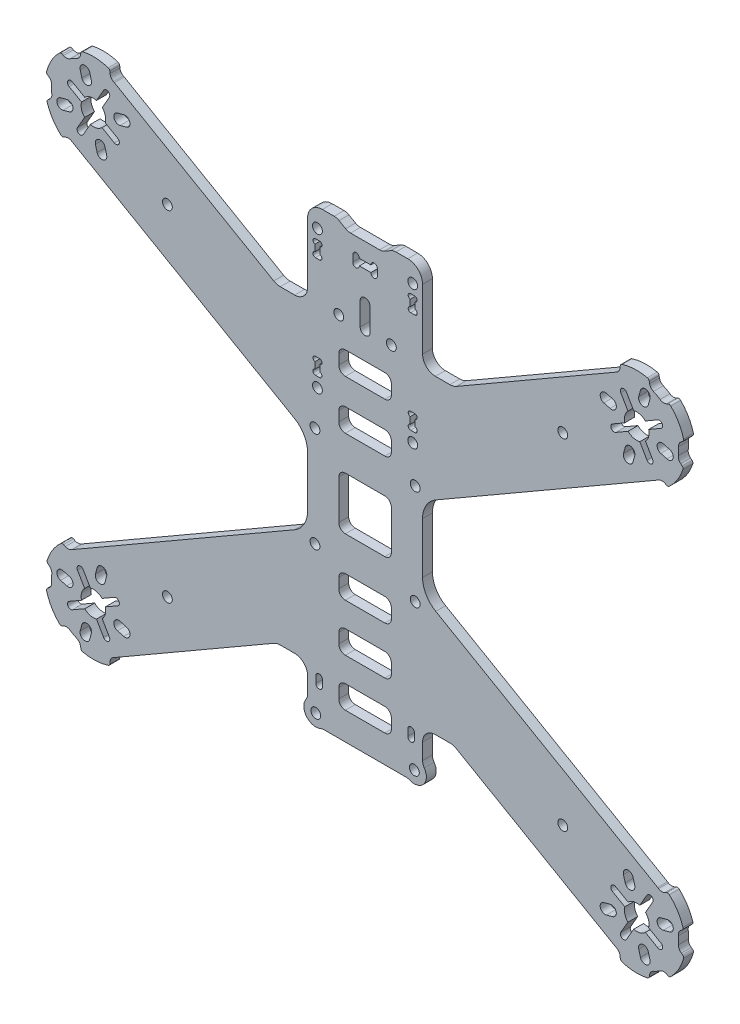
from build123d import *

# Parameters (mm, degrees)
ESQUISSE1_R        = 1.5
BOSS_EXTRU_1_DEPTH = 3


with BuildPart() as part:
    # Esquisse1 → Boss.-Extru.1 (new body)
    with BuildSketch(Plane(origin=(0, 0, 0), x_dir=(-1, 0, 0), z_dir=(0, 0, -1))):
        with BuildLine():
            Line((13, 74.000001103), (9.404163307, 74.000001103))
            ThreePointArc((9.404163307, 74.000001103), (8.634495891, 73.899589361), (7.916350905, 73.605075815))
            Line((7.916350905, 73.605075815), (5.914423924, 72.461733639))
            ThreePointArc((5.914423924, 72.461733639), (5.196278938, 72.167220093), (4.426611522, 72.066808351))
            Line((4.426611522, 72.066808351), (-4.426611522, 72.066808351))
            ThreePointArc((-4.426611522, 72.066808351), (-5.196278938, 72.167220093), (-5.914423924, 72.461733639))
            Line((-5.914423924, 72.461733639), (-7.916350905, 73.605075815))
            ThreePointArc((-7.916350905, 73.605075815), (-8.634495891, 73.899589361), (-9.404163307, 74.000001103))
            Line((-9.404163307, 74.000001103), (-13, 74.000001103))
            ThreePointArc((-13, 74.000001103), (-16.181980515, 72.681981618), (-17.5, 69.500001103))
            Line((-17.5, 69.500001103), (-17.5, 51.136797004))
            ThreePointArc((-17.5, 51.136797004), (-18.645234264, 48.371956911), (-21.410074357, 47.226722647))
            Line((-21.410074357, 47.226722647), (-25.80389257, 47.226722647))
            ThreePointArc((-25.80389257, 47.226722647), (-26.839168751, 47.363019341), (-27.80389257, 47.762621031))
            Line((-27.80389257, 47.762621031), (-76.304836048, 75.764653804))
            ThreePointArc((-76.304836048, 75.764653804), (-76.443738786, 75.843692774), (-76.583621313, 75.920984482))
            ThreePointArc((-76.583621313, 75.920984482), (-77.299049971, 76.579638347), (-77.619262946, 77.497857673))
            Line((-77.619262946, 77.497857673), (-77.674115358, 78.105876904))
            ThreePointArc((-77.674115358, 78.105876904), (-77.835837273, 78.507519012), (-78.192609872, 78.752842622))
            ThreePointArc((-78.192609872, 78.752842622), (-82.037317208, 79.438930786), (-85.927190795, 79.090541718))
            ThreePointArc((-85.927190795, 79.090541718), (-86.303987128, 78.87724642), (-86.500099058, 78.491227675))
            Line((-86.500099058, 78.491227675), (-86.607735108, 77.890302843))
            ThreePointArc((-86.607735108, 77.890302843), (-87.006757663, 77.003486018), (-87.776869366, 76.409692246))
            ThreePointArc((-87.776869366, 76.409692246), (-88.810662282, 75.902072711), (-89.7944316, 75.303237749))
            ThreePointArc((-89.7944316, 75.303237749), (-90.765401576, 74.968176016), (-91.774628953, 75.159249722))
            Line((-91.774628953, 75.159249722), (-92.174541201, 75.350858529))
            ThreePointArc((-92.174541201, 75.350858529), (-92.622489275, 75.414184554), (-93.025363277, 75.208368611))
            ThreePointArc((-93.025363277, 75.208368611), (-95.436494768, 72.087890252), (-96.933342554, 68.439549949))
            ThreePointArc((-96.933342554, 68.439549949), (-96.910147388, 67.987742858), (-96.631331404, 67.631471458))
            Line((-96.631331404, 67.631471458), (-96.265437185, 67.380941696))
            ThreePointArc((-96.265437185, 67.380941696), (-95.595348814, 66.602462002), (-95.400035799, 65.59404647))
            ThreePointArc((-95.400035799, 65.59404647), (-95.426757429, 64.442659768), (-95.349472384, 63.293559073))
            ThreePointArc((-95.349472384, 63.293559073), (-95.478657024, 62.329725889), (-96.047151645, 61.540753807))
            Line((-96.047151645, 61.540753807), (-96.51374979, 61.147075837))
            ThreePointArc((-96.51374979, 61.147075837), (-96.749995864, 60.784228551), (-96.746316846, 60.351265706))
            ThreePointArc((-96.746316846, 60.351265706), (-95.103093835, 56.808341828), (-92.586570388, 53.821771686))
            ThreePointArc((-92.586570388, 53.821771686), (-92.19572761, 53.635459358), (-91.767034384, 53.696225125))
            Line((-91.767034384, 53.696225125), (-91.213048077, 53.952731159))
            ThreePointArc((-91.213048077, 53.952731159), (-90.257740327, 54.134528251), (-89.329615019, 53.844275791))
            ThreePointArc((-89.329615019, 53.844275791), (-89.192737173, 53.761779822), (-89.054836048, 53.681006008))
            Line((-89.054836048, 53.681006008), (-21.5, 14.67820323))
            ThreePointArc((-21.5, 14.67820323), (-18.57179677, 11.75), (-17.5, 7.75))
            Line((-17.5, 7.75), (-17.5, -7.75))
            ThreePointArc((-17.5, -7.75), (-18.57179677, -11.75), (-21.5, -14.67820323))
            Line((-21.5, -14.67820323), (-89.054836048, -53.681006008))
            ThreePointArc((-89.054836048, -53.681006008), (-89.192737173, -53.761779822), (-89.329615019, -53.844275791))
            ThreePointArc((-89.329615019, -53.844275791), (-90.257740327, -54.134528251), (-91.213048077, -53.952731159))
            Line((-91.213048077, -53.952731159), (-91.767034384, -53.696225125))
            ThreePointArc((-91.767034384, -53.696225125), (-92.19572761, -53.635459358), (-92.586570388, -53.821771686))
            ThreePointArc((-92.586570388, -53.821771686), (-95.103093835, -56.808341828), (-96.746316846, -60.351265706))
            ThreePointArc((-96.746316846, -60.351265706), (-96.749995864, -60.784228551), (-96.51374979, -61.147075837))
            Line((-96.51374979, -61.147075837), (-96.047151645, -61.540753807))
            ThreePointArc((-96.047151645, -61.540753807), (-95.478657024, -62.329725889), (-95.349472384, -63.293559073))
            ThreePointArc((-95.349472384, -63.293559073), (-95.426757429, -64.442659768), (-95.400035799, -65.59404647))
            ThreePointArc((-95.400035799, -65.59404647), (-95.595348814, -66.602462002), (-96.265437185, -67.380941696))
            Line((-96.265437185, -67.380941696), (-96.631331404, -67.631471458))
            ThreePointArc((-96.631331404, -67.631471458), (-96.910147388, -67.987742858), (-96.933342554, -68.439549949))
            ThreePointArc((-96.933342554, -68.439549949), (-95.436494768, -72.087890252), (-93.025363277, -75.208368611))
            ThreePointArc((-93.025363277, -75.208368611), (-92.622489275, -75.414184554), (-92.174541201, -75.350858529))
            Line((-92.174541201, -75.350858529), (-91.774628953, -75.159249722))
            ThreePointArc((-91.774628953, -75.159249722), (-90.765401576, -74.968176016), (-89.7944316, -75.303237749))
            ThreePointArc((-89.7944316, -75.303237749), (-88.810662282, -75.902072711), (-87.776869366, -76.409692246))
            ThreePointArc((-87.776869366, -76.409692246), (-87.006757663, -77.003486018), (-86.607735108, -77.890302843))
            Line((-86.607735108, -77.890302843), (-86.500099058, -78.491227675))
            ThreePointArc((-86.500099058, -78.491227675), (-86.303987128, -78.87724642), (-85.927190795, -79.090541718))
            ThreePointArc((-85.927190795, -79.090541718), (-82.037317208, -79.438930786), (-78.192609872, -78.752842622))
            ThreePointArc((-78.192609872, -78.752842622), (-77.835837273, -78.507519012), (-77.674115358, -78.105876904))
            Line((-77.674115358, -78.105876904), (-77.619262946, -77.497857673))
            ThreePointArc((-77.619262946, -77.497857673), (-77.299049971, -76.579638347), (-76.583621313, -75.920984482))
            ThreePointArc((-76.583621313, -75.920984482), (-76.443738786, -75.843692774), (-76.304836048, -75.764653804))
            Line((-76.304836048, -75.764653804), (-27.80389257, -47.762621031))
            ThreePointArc((-27.80389257, -47.762621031), (-26.839168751, -47.363019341), (-25.80389257, -47.226722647))
            Line((-25.80389257, -47.226722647), (-21.410074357, -47.226722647))
            ThreePointArc((-21.410074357, -47.226722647), (-18.645234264, -48.371956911), (-17.5, -51.136797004))
            Line((-17.5, -51.136797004), (-17.5, -56.007516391))
            ThreePointArc((-17.5, -56.007516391), (-17.632878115, -56.890472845), (-18.019741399, -57.695212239))
            ThreePointArc((-18.019741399, -57.695212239), (-17.830684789, -62.058292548), (-13.594895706, -63.121449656))
            ThreePointArc((-13.594895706, -63.121449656), (-13.029288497, -62.948865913), (-12.440816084, -62.890583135))
            Line((-12.440816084, -62.890583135), (12.440816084, -62.890583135))
            ThreePointArc((12.440816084, -62.890583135), (13.029288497, -62.948865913), (13.594895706, -63.121449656))
            ThreePointArc((13.594895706, -63.121449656), (17.830684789, -62.058292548), (18.019741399, -57.695212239))
            ThreePointArc((18.019741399, -57.695212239), (17.632878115, -56.890472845), (17.5, -56.007516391))
            Line((17.5, -56.007516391), (17.5, -51.136797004))
            ThreePointArc((17.5, -51.136797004), (18.645234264, -48.371956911), (21.410074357, -47.226722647))
            Line((21.410074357, -47.226722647), (25.80389257, -47.226722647))
            ThreePointArc((25.80389257, -47.226722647), (26.839168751, -47.363019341), (27.80389257, -47.762621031))
            Line((27.80389257, -47.762621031), (76.304836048, -75.764653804))
            ThreePointArc((76.304836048, -75.764653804), (76.443738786, -75.843692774), (76.583621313, -75.920984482))
            ThreePointArc((76.583621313, -75.920984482), (77.299049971, -76.579638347), (77.619262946, -77.497857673))
            Line((77.619262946, -77.497857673), (77.674115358, -78.105876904))
            ThreePointArc((77.674115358, -78.105876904), (77.835837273, -78.507519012), (78.192609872, -78.752842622))
            ThreePointArc((78.192609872, -78.752842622), (82.037317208, -79.438930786), (85.927190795, -79.090541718))
            ThreePointArc((85.927190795, -79.090541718), (86.303987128, -78.87724642), (86.500099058, -78.491227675))
            Line((86.500099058, -78.491227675), (86.607735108, -77.890302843))
            ThreePointArc((86.607735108, -77.890302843), (87.006757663, -77.003486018), (87.776869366, -76.409692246))
            ThreePointArc((87.776869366, -76.409692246), (88.810662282, -75.902072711), (89.7944316, -75.303237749))
            ThreePointArc((89.7944316, -75.303237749), (90.765401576, -74.968176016), (91.774628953, -75.159249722))
            Line((91.774628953, -75.159249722), (92.174541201, -75.350858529))
            ThreePointArc((92.174541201, -75.350858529), (92.622489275, -75.414184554), (93.025363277, -75.208368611))
            ThreePointArc((93.025363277, -75.208368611), (95.436494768, -72.087890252), (96.933342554, -68.439549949))
            ThreePointArc((96.933342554, -68.439549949), (96.910147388, -67.987742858), (96.631331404, -67.631471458))
            Line((96.631331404, -67.631471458), (96.265437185, -67.380941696))
            ThreePointArc((96.265437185, -67.380941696), (95.595348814, -66.602462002), (95.400035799, -65.59404647))
            ThreePointArc((95.400035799, -65.59404647), (95.426757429, -64.442659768), (95.349472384, -63.293559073))
            ThreePointArc((95.349472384, -63.293559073), (95.478657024, -62.329725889), (96.047151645, -61.540753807))
            Line((96.047151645, -61.540753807), (96.51374979, -61.147075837))
            ThreePointArc((96.51374979, -61.147075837), (96.749995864, -60.784228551), (96.746316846, -60.351265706))
            ThreePointArc((96.746316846, -60.351265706), (95.103093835, -56.808341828), (92.586570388, -53.821771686))
            ThreePointArc((92.586570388, -53.821771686), (92.19572761, -53.635459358), (91.767034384, -53.696225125))
            Line((91.767034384, -53.696225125), (91.213048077, -53.952731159))
            ThreePointArc((91.213048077, -53.952731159), (90.257740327, -54.134528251), (89.329615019, -53.844275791))
            ThreePointArc((89.329615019, -53.844275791), (89.192737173, -53.761779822), (89.054836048, -53.681006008))
            Line((89.054836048, -53.681006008), (21.5, -14.67820323))
            ThreePointArc((21.5, -14.67820323), (18.57179677, -11.75), (17.5, -7.75))
            Line((17.5, -7.75), (17.5, 7.75))
            ThreePointArc((17.5, 7.75), (18.57179677, 11.75), (21.5, 14.67820323))
            Line((21.5, 14.67820323), (89.054836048, 53.681006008))
            ThreePointArc((89.054836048, 53.681006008), (89.192737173, 53.761779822), (89.329615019, 53.844275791))
            ThreePointArc((89.329615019, 53.844275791), (90.257740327, 54.134528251), (91.213048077, 53.952731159))
            Line((91.213048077, 53.952731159), (91.767034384, 53.696225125))
            ThreePointArc((91.767034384, 53.696225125), (92.19572761, 53.635459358), (92.586570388, 53.821771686))
            ThreePointArc((92.586570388, 53.821771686), (95.103093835, 56.808341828), (96.746316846, 60.351265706))
            ThreePointArc((96.746316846, 60.351265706), (96.749995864, 60.784228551), (96.51374979, 61.147075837))
            Line((96.51374979, 61.147075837), (96.047151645, 61.540753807))
            ThreePointArc((96.047151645, 61.540753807), (95.478657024, 62.329725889), (95.349472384, 63.293559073))
            ThreePointArc((95.349472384, 63.293559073), (95.426757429, 64.442659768), (95.400035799, 65.59404647))
            ThreePointArc((95.400035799, 65.59404647), (95.595348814, 66.602462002), (96.265437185, 67.380941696))
            Line((96.265437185, 67.380941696), (96.631331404, 67.631471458))
            ThreePointArc((96.631331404, 67.631471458), (96.910147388, 67.987742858), (96.933342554, 68.439549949))
            ThreePointArc((96.933342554, 68.439549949), (95.436494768, 72.087890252), (93.025363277, 75.208368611))
            ThreePointArc((93.025363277, 75.208368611), (92.622489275, 75.414184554), (92.174541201, 75.350858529))
            Line((92.174541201, 75.350858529), (91.774628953, 75.159249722))
            ThreePointArc((91.774628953, 75.159249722), (90.765401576, 74.968176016), (89.7944316, 75.303237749))
            ThreePointArc((89.7944316, 75.303237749), (88.810662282, 75.902072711), (87.776869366, 76.409692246))
            ThreePointArc((87.776869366, 76.409692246), (87.006757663, 77.003486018), (86.607735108, 77.890302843))
            Line((86.607735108, 77.890302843), (86.500099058, 78.491227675))
            ThreePointArc((86.500099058, 78.491227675), (86.303987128, 78.87724642), (85.927190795, 79.090541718))
            ThreePointArc((85.927190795, 79.090541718), (82.037317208, 79.438930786), (78.192609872, 78.752842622))
            ThreePointArc((78.192609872, 78.752842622), (77.835837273, 78.507519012), (77.674115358, 78.105876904))
            Line((77.674115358, 78.105876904), (77.619262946, 77.497857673))
            ThreePointArc((77.619262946, 77.497857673), (77.299049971, 76.579638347), (76.583621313, 75.920984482))
            ThreePointArc((76.583621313, 75.920984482), (76.443738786, 75.843692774), (76.304836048, 75.764653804))
            Line((76.304836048, 75.764653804), (27.80389257, 47.762621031))
            ThreePointArc((27.80389257, 47.762621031), (26.839168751, 47.363019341), (25.80389257, 47.226722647))
            Line((25.80389257, 47.226722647), (21.410074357, 47.226722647))
            ThreePointArc((21.410074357, 47.226722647), (18.645234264, 48.371956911), (17.5, 51.136797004))
            Line((17.5, 51.136797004), (17.5, 69.500001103))
            ThreePointArc((17.5, 69.500001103), (16.181980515, 72.681981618), (13, 74.000001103))
        make_face()
        with Locations(Location((15, -59.75, 0), (0, 0, 180))):
            Circle(ESQUISSE1_R, mode=Mode.SUBTRACT)
        with Locations(Location((-14.5, 68.25, 0), (0, 0, 180))):
            Circle(ESQUISSE1_R, mode=Mode.SUBTRACT)
        with Locations(Location((14.5, 26.25, 0), (0, 0, 180))):
            Circle(ESQUISSE1_R, mode=Mode.SUBTRACT)
        with Locations(Location((-15.25, 15.25, 0), (0, 0, 180))):
            Circle(ESQUISSE1_R, mode=Mode.SUBTRACT)
        with Locations(Location((15.25, -15.25, 0), (0, 0, 180))):
            Circle(ESQUISSE1_R, mode=Mode.SUBTRACT)
        with Locations(Location((15.25, 15.25, 0), (0, 0, 180))):
            Circle(ESQUISSE1_R, mode=Mode.SUBTRACT)
        with Locations(Location((-15.25, -15.25, 0), (0, 0, 180))):
            Circle(ESQUISSE1_R, mode=Mode.SUBTRACT)
        with Locations(Location((-14.5, 26.25, 0), (0, 0, 180))):
            Circle(ESQUISSE1_R, mode=Mode.SUBTRACT)
        with Locations(Location((14.5, 68.25, 0), (0, 0, 180))):
            Circle(ESQUISSE1_R, mode=Mode.SUBTRACT)
        with Locations(Location((-15, -59.75, 0), (0, 0, 180))):
            Circle(ESQUISSE1_R, mode=Mode.SUBTRACT)
        with Locations(Location((8, 48.75, 0), (0, 0, 180))):
            Circle(ESQUISSE1_R, mode=Mode.SUBTRACT)
        with Locations(Location((-8, 48.75, 0), (0, 0, 180))):
            Circle(ESQUISSE1_R, mode=Mode.SUBTRACT)
        with Locations(Location((-60.16317555, 51.722829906, 0), (0, 0, 180))):
            Circle(ESQUISSE1_R, mode=Mode.SUBTRACT)
        with Locations(Location((60.16317555, -51.722829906, 0), (0, 0, 180))):
            Circle(ESQUISSE1_R, mode=Mode.SUBTRACT)
        with Locations(Location((-60.16317555, -51.722829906, 0), (0, 0, 180))):
            Circle(ESQUISSE1_R, mode=Mode.SUBTRACT)
        with Locations(Location((60.16317555, 51.722829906, 0), (0, 0, 180))):
            Circle(ESQUISSE1_R, mode=Mode.SUBTRACT)
        with BuildLine():
            Line((80.049840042, 62.049700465), (76.287170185, 59.877322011))
            ThreePointArc((76.287170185, 59.877322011), (74.921144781, 60.243347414), (75.287170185, 61.609372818))
            Line((75.287170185, 61.609372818), (79.049840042, 63.781751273))
            ThreePointArc((79.049840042, 63.781751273), (79.0576142, 65.693401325), (80.006706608, 67.352825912))
            Line((80.006706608, 67.352825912), (77.834328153, 71.115495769))
            ThreePointArc((77.834328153, 71.115495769), (78.200353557, 72.481521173), (79.56637896, 72.115495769))
            Line((79.56637896, 72.115495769), (81.738757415, 68.352825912))
            ThreePointArc((81.738757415, 68.352825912), (83.650407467, 68.345051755), (85.309832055, 67.395959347))
            Line((85.309832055, 67.395959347), (89.072501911, 69.568337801))
            ThreePointArc((89.072501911, 69.568337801), (90.438527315, 69.202312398), (90.072501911, 67.836286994))
            Line((90.072501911, 67.836286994), (86.309832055, 65.663908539))
            ThreePointArc((86.309832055, 65.663908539), (86.302057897, 63.752258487), (85.352965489, 62.0928339))
            Line((85.352965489, 62.0928339), (87.525343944, 58.330164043))
            ThreePointArc((87.525343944, 58.330164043), (87.15931854, 56.964138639), (85.793293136, 57.330164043))
            Line((85.793293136, 57.330164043), (83.620914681, 61.0928339))
            ThreePointArc((83.620914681, 61.0928339), (81.709264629, 61.100608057), (80.049840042, 62.049700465))
        make_face(mode=Mode.SUBTRACT)
        with BuildLine():
            Line((83.297389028, 72.82312396), (83.80938347, 74.73391323))
            ThreePointArc((83.80938347, 74.73391323), (85.646500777, 75.794573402), (86.707160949, 73.957456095))
            Line((86.707160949, 73.957456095), (86.195166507, 72.046666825))
            ThreePointArc((86.195166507, 72.046666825), (84.3580492, 70.986006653), (83.297389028, 72.82312396))
        make_face(mode=Mode.SUBTRACT)
        with BuildLine():
            Line((90.780130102, 64.105276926), (92.690919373, 63.593282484))
            ThreePointArc((92.690919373, 63.593282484), (93.751579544, 61.756165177), (91.914462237, 60.695505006))
            Line((91.914462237, 60.695505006), (90.003672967, 61.207499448))
            ThreePointArc((90.003672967, 61.207499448), (88.943012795, 63.044616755), (90.780130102, 64.105276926))
        make_face(mode=Mode.SUBTRACT)
        with BuildLine():
            Line((74.579541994, 65.340382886), (72.668752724, 65.852377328))
            ThreePointArc((72.668752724, 65.852377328), (71.608092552, 67.689494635), (73.445209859, 68.750154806))
            Line((73.445209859, 68.750154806), (75.355999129, 68.238160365))
            ThreePointArc((75.355999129, 68.238160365), (76.416659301, 66.401043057), (74.579541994, 65.340382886))
        make_face(mode=Mode.SUBTRACT)
        with BuildLine():
            Line((82.062283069, 56.622535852), (81.550288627, 54.711746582))
            ThreePointArc((81.550288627, 54.711746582), (79.71317132, 53.65108641), (78.652511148, 55.488203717))
            Line((78.652511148, 55.488203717), (79.16450559, 57.398992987))
            ThreePointArc((79.16450559, 57.398992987), (81.001622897, 58.459653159), (82.062283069, 56.622535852))
        make_face(mode=Mode.SUBTRACT)
        with BuildLine():
            Line((-77.834328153, 71.115495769), (-80.006706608, 67.352825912))
            ThreePointArc((-80.006706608, 67.352825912), (-79.0576142, 65.693401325), (-79.049840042, 63.781751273))
            Line((-79.049840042, 63.781751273), (-75.287170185, 61.609372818))
            ThreePointArc((-75.287170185, 61.609372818), (-74.921144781, 60.243347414), (-76.287170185, 59.877322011))
            Line((-76.287170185, 59.877322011), (-80.049840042, 62.049700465))
            ThreePointArc((-80.049840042, 62.049700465), (-81.709264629, 61.100608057), (-83.620914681, 61.0928339))
            Line((-83.620914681, 61.0928339), (-85.793293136, 57.330164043))
            ThreePointArc((-85.793293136, 57.330164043), (-87.15931854, 56.964138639), (-87.525343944, 58.330164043))
            Line((-87.525343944, 58.330164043), (-85.352965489, 62.0928339))
            ThreePointArc((-85.352965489, 62.0928339), (-86.302057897, 63.752258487), (-86.309832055, 65.663908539))
            Line((-86.309832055, 65.663908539), (-90.072501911, 67.836286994))
            ThreePointArc((-90.072501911, 67.836286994), (-90.438527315, 69.202312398), (-89.072501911, 69.568337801))
            Line((-89.072501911, 69.568337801), (-85.309832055, 67.395959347))
            ThreePointArc((-85.309832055, 67.395959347), (-83.650407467, 68.345051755), (-81.738757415, 68.352825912))
            Line((-81.738757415, 68.352825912), (-79.56637896, 72.115495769))
            ThreePointArc((-79.56637896, 72.115495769), (-78.200353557, 72.481521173), (-77.834328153, 71.115495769))
        make_face(mode=Mode.SUBTRACT)
        with BuildLine():
            Line((-83.80938347, 74.73391323), (-83.297389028, 72.82312396))
            ThreePointArc((-83.297389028, 72.82312396), (-84.3580492, 70.986006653), (-86.195166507, 72.046666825))
            Line((-86.195166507, 72.046666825), (-86.707160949, 73.957456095))
            ThreePointArc((-86.707160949, 73.957456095), (-85.646500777, 75.794573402), (-83.80938347, 74.73391323))
        make_face(mode=Mode.SUBTRACT)
        with BuildLine():
            Line((-92.690919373, 63.593282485), (-90.780130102, 64.105276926))
            ThreePointArc((-90.780130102, 64.105276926), (-88.943012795, 63.044616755), (-90.003672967, 61.207499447))
            Line((-90.003672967, 61.207499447), (-91.914462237, 60.695505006))
            ThreePointArc((-91.914462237, 60.695505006), (-93.751579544, 61.756165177), (-92.690919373, 63.593282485))
        make_face(mode=Mode.SUBTRACT)
        with BuildLine():
            Line((-72.668752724, 65.852377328), (-74.579541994, 65.340382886))
            ThreePointArc((-74.579541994, 65.340382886), (-76.416659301, 66.401043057), (-75.355999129, 68.238160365))
            Line((-75.355999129, 68.238160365), (-73.445209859, 68.750154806))
            ThreePointArc((-73.445209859, 68.750154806), (-71.608092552, 67.689494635), (-72.668752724, 65.852377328))
        make_face(mode=Mode.SUBTRACT)
        with BuildLine():
            Line((-81.550288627, 54.711746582), (-82.062283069, 56.622535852))
            ThreePointArc((-82.062283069, 56.622535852), (-81.001622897, 58.459653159), (-79.16450559, 57.398992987))
            Line((-79.16450559, 57.398992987), (-78.652511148, 55.488203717))
            ThreePointArc((-78.652511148, 55.488203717), (-79.71317132, 53.65108641), (-81.550288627, 54.711746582))
        make_face(mode=Mode.SUBTRACT)
        with BuildLine():
            Line((77.834328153, -71.115495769), (80.006706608, -67.352825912))
            ThreePointArc((80.006706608, -67.352825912), (79.0576142, -65.693401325), (79.049840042, -63.781751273))
            Line((79.049840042, -63.781751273), (75.287170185, -61.609372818))
            ThreePointArc((75.287170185, -61.609372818), (74.921144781, -60.243347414), (76.287170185, -59.877322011))
            Line((76.287170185, -59.877322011), (80.049840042, -62.049700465))
            ThreePointArc((80.049840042, -62.049700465), (81.709264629, -61.100608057), (83.620914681, -61.0928339))
            Line((83.620914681, -61.0928339), (85.793293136, -57.330164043))
            ThreePointArc((85.793293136, -57.330164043), (87.15931854, -56.964138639), (87.525343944, -58.330164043))
            Line((87.525343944, -58.330164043), (85.352965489, -62.0928339))
            ThreePointArc((85.352965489, -62.0928339), (86.302057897, -63.752258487), (86.309832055, -65.663908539))
            Line((86.309832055, -65.663908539), (90.072501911, -67.836286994))
            ThreePointArc((90.072501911, -67.836286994), (90.438527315, -69.202312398), (89.072501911, -69.568337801))
            Line((89.072501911, -69.568337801), (85.309832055, -67.395959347))
            ThreePointArc((85.309832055, -67.395959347), (83.650407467, -68.345051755), (81.738757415, -68.352825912))
            Line((81.738757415, -68.352825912), (79.56637896, -72.115495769))
            ThreePointArc((79.56637896, -72.115495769), (78.200353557, -72.481521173), (77.834328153, -71.115495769))
        make_face(mode=Mode.SUBTRACT)
        with BuildLine():
            Line((83.80938347, -74.73391323), (83.297389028, -72.82312396))
            ThreePointArc((83.297389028, -72.82312396), (84.3580492, -70.986006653), (86.195166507, -72.046666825))
            Line((86.195166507, -72.046666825), (86.707160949, -73.957456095))
            ThreePointArc((86.707160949, -73.957456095), (85.646500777, -75.794573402), (83.80938347, -74.73391323))
        make_face(mode=Mode.SUBTRACT)
        with BuildLine():
            Line((92.690919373, -63.593282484), (90.780130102, -64.105276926))
            ThreePointArc((90.780130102, -64.105276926), (88.943012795, -63.044616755), (90.003672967, -61.207499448))
            Line((90.003672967, -61.207499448), (91.914462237, -60.695505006))
            ThreePointArc((91.914462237, -60.695505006), (93.751579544, -61.756165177), (92.690919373, -63.593282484))
        make_face(mode=Mode.SUBTRACT)
        with BuildLine():
            Line((72.668752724, -65.852377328), (74.579541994, -65.340382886))
            ThreePointArc((74.579541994, -65.340382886), (76.416659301, -66.401043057), (75.355999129, -68.238160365))
            Line((75.355999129, -68.238160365), (73.445209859, -68.750154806))
            ThreePointArc((73.445209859, -68.750154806), (71.608092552, -67.689494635), (72.668752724, -65.852377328))
        make_face(mode=Mode.SUBTRACT)
        with BuildLine():
            Line((81.550288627, -54.711746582), (82.062283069, -56.622535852))
            ThreePointArc((82.062283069, -56.622535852), (81.001622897, -58.459653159), (79.16450559, -57.398992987))
            Line((79.16450559, -57.398992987), (78.652511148, -55.488203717))
            ThreePointArc((78.652511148, -55.488203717), (79.71317132, -53.65108641), (81.550288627, -54.711746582))
        make_face(mode=Mode.SUBTRACT)
        with BuildLine():
            Line((-80.049840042, -62.049700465), (-76.287170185, -59.877322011))
            ThreePointArc((-76.287170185, -59.877322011), (-74.921144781, -60.243347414), (-75.287170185, -61.609372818))
            Line((-75.287170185, -61.609372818), (-79.049840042, -63.781751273))
            ThreePointArc((-79.049840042, -63.781751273), (-79.0576142, -65.693401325), (-80.006706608, -67.352825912))
            Line((-80.006706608, -67.352825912), (-77.834328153, -71.115495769))
            ThreePointArc((-77.834328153, -71.115495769), (-78.200353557, -72.481521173), (-79.56637896, -72.115495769))
            Line((-79.56637896, -72.115495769), (-81.738757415, -68.352825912))
            ThreePointArc((-81.738757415, -68.352825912), (-83.650407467, -68.345051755), (-85.309832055, -67.395959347))
            Line((-85.309832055, -67.395959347), (-89.072501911, -69.568337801))
            ThreePointArc((-89.072501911, -69.568337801), (-90.438527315, -69.202312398), (-90.072501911, -67.836286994))
            Line((-90.072501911, -67.836286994), (-86.309832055, -65.663908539))
            ThreePointArc((-86.309832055, -65.663908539), (-86.302057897, -63.752258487), (-85.352965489, -62.0928339))
            Line((-85.352965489, -62.0928339), (-87.525343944, -58.330164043))
            ThreePointArc((-87.525343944, -58.330164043), (-87.15931854, -56.964138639), (-85.793293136, -57.330164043))
            Line((-85.793293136, -57.330164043), (-83.620914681, -61.0928339))
            ThreePointArc((-83.620914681, -61.0928339), (-81.709264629, -61.100608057), (-80.049840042, -62.049700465))
        make_face(mode=Mode.SUBTRACT)
        with BuildLine():
            Line((-83.297389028, -72.82312396), (-83.80938347, -74.73391323))
            ThreePointArc((-83.80938347, -74.73391323), (-85.646500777, -75.794573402), (-86.707160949, -73.957456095))
            Line((-86.707160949, -73.957456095), (-86.195166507, -72.046666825))
            ThreePointArc((-86.195166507, -72.046666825), (-84.3580492, -70.986006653), (-83.297389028, -72.82312396))
        make_face(mode=Mode.SUBTRACT)
        with BuildLine():
            Line((-90.780130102, -64.105276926), (-92.690919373, -63.593282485))
            ThreePointArc((-92.690919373, -63.593282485), (-93.751579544, -61.756165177), (-91.914462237, -60.695505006))
            Line((-91.914462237, -60.695505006), (-90.003672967, -61.207499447))
            ThreePointArc((-90.003672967, -61.207499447), (-88.943012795, -63.044616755), (-90.780130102, -64.105276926))
        make_face(mode=Mode.SUBTRACT)
        with BuildLine():
            Line((-74.579541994, -65.340382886), (-72.668752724, -65.852377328))
            ThreePointArc((-72.668752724, -65.852377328), (-71.608092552, -67.689494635), (-73.445209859, -68.750154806))
            Line((-73.445209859, -68.750154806), (-75.355999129, -68.238160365))
            ThreePointArc((-75.355999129, -68.238160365), (-76.416659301, -66.401043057), (-74.579541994, -65.340382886))
        make_face(mode=Mode.SUBTRACT)
        with BuildLine():
            Line((-82.062283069, -56.622535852), (-81.550288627, -54.711746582))
            ThreePointArc((-81.550288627, -54.711746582), (-79.71317132, -53.65108641), (-78.652511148, -55.488203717))
            Line((-78.652511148, -55.488203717), (-79.16450559, -57.398992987))
            ThreePointArc((-79.16450559, -57.398992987), (-81.001622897, -58.459653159), (-82.062283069, -56.622535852))
        make_face(mode=Mode.SUBTRACT)
        with BuildLine():
            Line((6.000000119, 18.500000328), (-6.000000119, 18.500000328))
            ThreePointArc((-6.000000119, 18.500000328), (-7.414213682, 19.085786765), (-8.000000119, 20.500000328))
            Line((-8.000000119, 20.500000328), (-8.000000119, 23.500000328))
            ThreePointArc((-8.000000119, 23.500000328), (-7.414213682, 24.91421389), (-6.000000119, 25.500000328))
            Line((-6.000000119, 25.500000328), (6.000000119, 25.500000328))
            ThreePointArc((6.000000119, 25.500000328), (7.414213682, 24.91421389), (8.000000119, 23.500000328))
            Line((8.000000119, 23.500000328), (8.000000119, 20.500000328))
            ThreePointArc((8.000000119, 20.500000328), (7.414213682, 19.085786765), (6.000000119, 18.500000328))
        make_face(mode=Mode.SUBTRACT)
        with BuildLine():
            Line((-8.000000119, -23.500000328), (-8.000000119, -20.500000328))
            ThreePointArc((-8.000000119, -20.500000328), (-7.414213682, -19.085786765), (-6.000000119, -18.500000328))
            Line((-6.000000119, -18.500000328), (6.000000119, -18.500000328))
            ThreePointArc((6.000000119, -18.500000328), (7.414213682, -19.085786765), (8.000000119, -20.500000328))
            Line((8.000000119, -20.500000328), (8.000000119, -23.500000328))
            ThreePointArc((8.000000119, -23.500000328), (7.414213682, -24.91421389), (6.000000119, -25.500000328))
            Line((6.000000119, -25.500000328), (-6.000000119, -25.500000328))
            ThreePointArc((-6.000000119, -25.500000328), (-7.414213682, -24.91421389), (-8.000000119, -23.500000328))
        make_face(mode=Mode.SUBTRACT)
        with BuildLine():
            Line((8.000000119, -35.000000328), (8.000000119, -38.000000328))
            ThreePointArc((8.000000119, -38.000000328), (7.414213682, -39.41421389), (6.000000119, -40.000000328))
            Line((6.000000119, -40.000000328), (-6.000000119, -40.000000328))
            ThreePointArc((-6.000000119, -40.000000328), (-7.414213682, -39.41421389), (-8.000000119, -38.000000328))
            Line((-8.000000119, -38.000000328), (-8.000000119, -35.000000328))
            ThreePointArc((-8.000000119, -35.000000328), (-7.414213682, -33.585786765), (-6.000000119, -33.000000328))
            Line((-6.000000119, -33.000000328), (6.000000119, -33.000000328))
            ThreePointArc((6.000000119, -33.000000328), (7.414213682, -33.585786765), (8.000000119, -35.000000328))
        make_face(mode=Mode.SUBTRACT)
        with BuildLine():
            Line((6.000000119, -8.000000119), (-6.000000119, -8.000000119))
            ThreePointArc((-6.000000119, -8.000000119), (-7.414213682, -7.414213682), (-8.000000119, -6.000000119))
            Line((-8.000000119, -6.000000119), (-8.000000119, 6.000000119))
            ThreePointArc((-8.000000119, 6.000000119), (-7.414213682, 7.414213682), (-6.000000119, 8.000000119))
            Line((-6.000000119, 8.000000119), (6.000000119, 8.000000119))
            ThreePointArc((6.000000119, 8.000000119), (7.414213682, 7.414213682), (8.000000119, 6.000000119))
            Line((8.000000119, 6.000000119), (8.000000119, -6.000000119))
            ThreePointArc((8.000000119, -6.000000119), (7.414213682, -7.414213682), (6.000000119, -8.000000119))
        make_face(mode=Mode.SUBTRACT)
        with BuildLine():
            Line((-6.000000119, 40.500000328), (6.000000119, 40.500000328))
            ThreePointArc((6.000000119, 40.500000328), (7.414213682, 39.91421389), (8.000000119, 38.500000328))
            Line((8.000000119, 38.500000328), (8.000000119, 35.500000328))
            ThreePointArc((8.000000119, 35.500000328), (7.414213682, 34.085786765), (6.000000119, 33.500000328))
            Line((6.000000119, 33.500000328), (-6.000000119, 33.500000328))
            ThreePointArc((-6.000000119, 33.500000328), (-7.414213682, 34.085786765), (-8.000000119, 35.500000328))
            Line((-8.000000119, 35.500000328), (-8.000000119, 38.500000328))
            ThreePointArc((-8.000000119, 38.500000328), (-7.414213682, 39.91421389), (-6.000000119, 40.500000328))
        make_face(mode=Mode.SUBTRACT)
        with BuildLine():
            Line((8.000000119, -49.500000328), (8.000000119, -52.500000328))
            ThreePointArc((8.000000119, -52.500000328), (7.414213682, -53.91421389), (6.000000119, -54.500000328))
            Line((6.000000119, -54.500000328), (-6.000000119, -54.500000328))
            ThreePointArc((-6.000000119, -54.500000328), (-7.414213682, -53.91421389), (-8.000000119, -52.500000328))
            Line((-8.000000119, -52.500000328), (-8.000000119, -49.500000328))
            ThreePointArc((-8.000000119, -49.500000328), (-7.414213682, -48.085786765), (-6.000000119, -47.500000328))
            Line((-6.000000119, -47.500000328), (6.000000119, -47.500000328))
            ThreePointArc((6.000000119, -47.500000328), (7.414213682, -48.085786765), (8.000000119, -49.500000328))
        make_face(mode=Mode.SUBTRACT)
        with BuildLine():
            Line((1.75, 64.75), (-1.755303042, 64.75))
            ThreePointArc((-1.755303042, 64.75), (-2.748681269, 63.755303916), (-3.744693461, 64.74736254))
            Line((-3.744693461, 64.74736254), (-3.749996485, 66.747348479))
            ThreePointArc((-3.749996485, 66.747348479), (-2.751325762, 67.749999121), (-1.75, 66.75))
            Line((-1.75, 66.75), (1.75, 66.75))
            ThreePointArc((1.75, 66.75), (2.75, 67.75), (3.75, 66.75))
            Line((3.75, 66.75), (3.75, 64.75))
            ThreePointArc((3.75, 64.75), (2.75, 63.75), (1.75, 64.75))
        make_face(mode=Mode.SUBTRACT)
        with BuildLine():
            Line((-13.75, 63.746654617), (-13.75, 61.732640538))
            ThreePointArc((-13.75, 61.732640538), (-13.127627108, 60.93041087), (-13.875, 60.243130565))
            Line((-13.875, 60.243130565), (-15.125, 60.243130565))
            ThreePointArc((-15.125, 60.243130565), (-15.872372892, 60.93041087), (-15.25, 61.732640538))
            Line((-15.25, 61.732640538), (-15.25, 63.746654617))
            ThreePointArc((-15.25, 63.746654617), (-15.879266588, 64.555846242), (-15.125, 65.25))
            Line((-15.125, 65.25), (-13.875, 65.25))
            ThreePointArc((-13.875, 65.25), (-13.120733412, 64.555846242), (-13.75, 63.746654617))
        make_face(mode=Mode.SUBTRACT)
        with BuildLine():
            Line((13, -51.890583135), (13, -49.890583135))
            ThreePointArc((13, -49.890583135), (14, -48.890583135), (15, -49.890583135))
            Line((15, -49.890583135), (15, -51.890583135))
            ThreePointArc((15, -51.890583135), (14, -52.890583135), (13, -51.890583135))
        make_face(mode=Mode.SUBTRACT)
        with BuildLine():
            Line((-13.875, 29.25), (-15.125, 29.25))
            ThreePointArc((-15.125, 29.25), (-15.879266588, 29.944153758), (-15.25, 30.753345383))
            Line((-15.25, 30.753345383), (-15.25, 32.767359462))
            ThreePointArc((-15.25, 32.767359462), (-15.872372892, 33.56958913), (-15.125, 34.256869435))
            Line((-15.125, 34.256869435), (-13.875, 34.256869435))
            ThreePointArc((-13.875, 34.256869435), (-13.127627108, 33.56958913), (-13.75, 32.767359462))
            Line((-13.75, 32.767359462), (-13.75, 30.753345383))
            ThreePointArc((-13.75, 30.753345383), (-13.120733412, 29.944153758), (-13.875, 29.25))
        make_face(mode=Mode.SUBTRACT)
        with BuildLine():
            Line((13.875, 34.256869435), (15.125, 34.256869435))
            ThreePointArc((15.125, 34.256869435), (15.872372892, 33.56958913), (15.25, 32.767359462))
            Line((15.25, 32.767359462), (15.25, 30.753345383))
            ThreePointArc((15.25, 30.753345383), (15.879266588, 29.944153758), (15.125, 29.25))
            Line((15.125, 29.25), (13.875, 29.25))
            ThreePointArc((13.875, 29.25), (13.120733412, 29.944153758), (13.75, 30.753345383))
            Line((13.75, 30.753345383), (13.75, 32.767359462))
            ThreePointArc((13.75, 32.767359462), (13.127627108, 33.56958913), (13.875, 34.256869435))
        make_face(mode=Mode.SUBTRACT)
        with BuildLine():
            Line((-1.5, 48.75), (-1.5, 55.75))
            ThreePointArc((-1.5, 55.75), (0, 57.25), (1.5, 55.75))
            Line((1.5, 55.75), (1.5, 48.75))
            ThreePointArc((1.5, 48.75), (0, 47.25), (-1.5, 48.75))
        make_face(mode=Mode.SUBTRACT)
        with BuildLine():
            Line((-13, -49.890583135), (-13, -51.890583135))
            ThreePointArc((-13, -51.890583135), (-14, -52.890583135), (-15, -51.890583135))
            Line((-15, -51.890583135), (-15, -49.890583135))
            ThreePointArc((-15, -49.890583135), (-14, -48.890583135), (-13, -49.890583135))
        make_face(mode=Mode.SUBTRACT)
        with BuildLine():
            Line((15.25, 63.746654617), (15.25, 61.732640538))
            ThreePointArc((15.25, 61.732640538), (15.872372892, 60.93041087), (15.125, 60.243130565))
            Line((15.125, 60.243130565), (13.875, 60.243130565))
            ThreePointArc((13.875, 60.243130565), (13.127627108, 60.93041087), (13.75, 61.732640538))
            Line((13.75, 61.732640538), (13.75, 63.746654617))
            ThreePointArc((13.75, 63.746654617), (13.120733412, 64.555846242), (13.875, 65.25))
            Line((13.875, 65.25), (15.125, 65.25))
            ThreePointArc((15.125, 65.25), (15.879266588, 64.555846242), (15.25, 63.746654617))
        make_face(mode=Mode.SUBTRACT)
    extrude(amount=-BOSS_EXTRU_1_DEPTH)


solid = part.part
